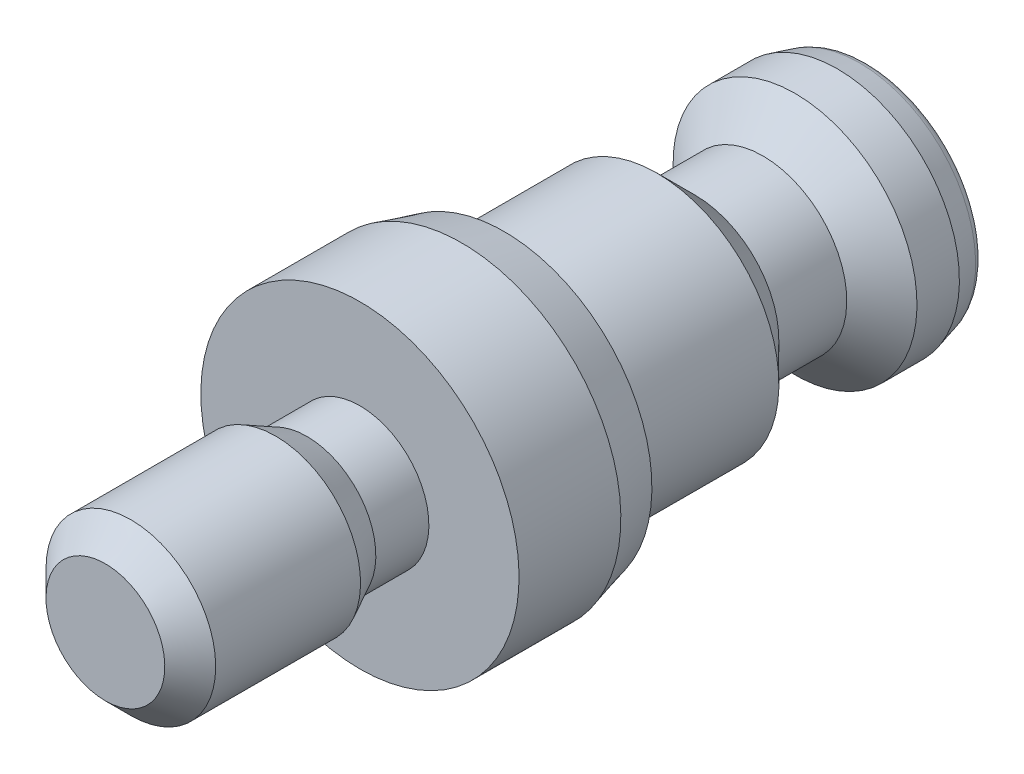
ISO-10303-21;
HEADER;
FILE_DESCRIPTION(('STEP AP214'),'2;1');
FILE_NAME('part.step','',(''),(''),'','','');
FILE_SCHEMA(('AUTOMOTIVE_DESIGN { 1 0 10303 214 1 1 1 1 }'));
ENDSEC;
DATA;
#1=APPLICATION_CONTEXT('core data for automotive mechanical design processes');
#2=APPLICATION_PROTOCOL_DEFINITION('international standard','automotive_design',2000,#1);
#3=PRODUCT_CONTEXT('',#1,'mechanical');
#4=PRODUCT('Part','Part','',(#3));
#5=PRODUCT_RELATED_PRODUCT_CATEGORY('part','',(#4));
#6=PRODUCT_DEFINITION_FORMATION('','',#4);
#7=PRODUCT_DEFINITION_CONTEXT('part definition',#1,'design');
#8=PRODUCT_DEFINITION('design','',#6,#7);
#9=PRODUCT_DEFINITION_SHAPE('','',#8);
#10=(LENGTH_UNIT() NAMED_UNIT(*) SI_UNIT(.MILLI.,.METRE.));
#11=(NAMED_UNIT(*) PLANE_ANGLE_UNIT() SI_UNIT($,.RADIAN.));
#12=(NAMED_UNIT(*) SI_UNIT($,.STERADIAN.) SOLID_ANGLE_UNIT());
#13=UNCERTAINTY_MEASURE_WITH_UNIT(LENGTH_MEASURE(1.E-05),#10,'distance_accuracy_value','');
#14=(GEOMETRIC_REPRESENTATION_CONTEXT(3) GLOBAL_UNCERTAINTY_ASSIGNED_CONTEXT((#13)) GLOBAL_UNIT_ASSIGNED_CONTEXT((#10,
#11,#12)) REPRESENTATION_CONTEXT('',''));
#15=CARTESIAN_POINT('',(0.,0.,0.));
#16=DIRECTION('',(0.,0.,1.));
#17=DIRECTION('',(1.,0.,0.));
#18=AXIS2_PLACEMENT_3D('',#15,#16,#17);
#19=CARTESIAN_POINT('',(0.,-6.,6.));
#20=DIRECTION('',(0.,0.,-1.));
#21=DIRECTION('',(0.,1.,0.));
#22=AXIS2_PLACEMENT_3D('',#19,#20,#21);
#23=CYLINDRICAL_SURFACE('',#22,5.75);
#24=CARTESIAN_POINT('',(0.,-6.,-8.));
#25=DIRECTION('',(0.,0.,-1.));
#26=DIRECTION('',(0.,1.,0.));
#27=AXIS2_PLACEMENT_3D('',#24,#25,#26);
#28=CIRCLE('',#27,5.75);
#29=CARTESIAN_POINT('',(0.,-0.25,-7.99999999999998));
#30=VERTEX_POINT('',#29);
#31=EDGE_CURVE('E138',#30,#30,#28,.T.);
#32=ORIENTED_EDGE('',*,*,#31,.F.);
#33=EDGE_LOOP('',(#32));
#34=FACE_BOUND('',#33,.T.);
#35=CARTESIAN_POINT('',(0.,-6.,-0.8));
#36=DIRECTION('',(0.,0.,1.));
#37=DIRECTION('',(0.,-1.,0.));
#38=AXIS2_PLACEMENT_3D('',#35,#36,#37);
#39=CIRCLE('',#38,5.75);
#40=CARTESIAN_POINT('',(0.,-11.75,-0.80000000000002));
#41=VERTEX_POINT('',#40);
#42=EDGE_CURVE('E123',#41,#41,#39,.T.);
#43=ORIENTED_EDGE('',*,*,#42,.F.);
#44=EDGE_LOOP('',(#43));
#45=FACE_BOUND('',#44,.T.);
#46=ADVANCED_FACE('F15',(#34,#45),#23,.T.);
#47=CARTESIAN_POINT('',(0.,-6.,-9.8));
#48=DIRECTION('',(0.,0.,1.));
#49=DIRECTION('',(0.,-1.,0.));
#50=AXIS2_PLACEMENT_3D('',#47,#48,#49);
#51=CONICAL_SURFACE('',#50,3.95,0.785398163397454);
#52=ORIENTED_EDGE('',*,*,#31,.T.);
#53=EDGE_LOOP('',(#52));
#54=FACE_BOUND('',#53,.T.);
#55=CARTESIAN_POINT('',(0.,-6.,-9.8));
#56=DIRECTION('',(0.,0.,-1.));
#57=DIRECTION('',(0.,1.,0.));
#58=AXIS2_PLACEMENT_3D('',#55,#56,#57);
#59=CIRCLE('',#58,3.95);
#60=CARTESIAN_POINT('',(0.,-2.05,-9.79999999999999));
#61=VERTEX_POINT('',#60);
#62=EDGE_CURVE('E135',#61,#61,#59,.T.);
#63=ORIENTED_EDGE('',*,*,#62,.F.);
#64=EDGE_LOOP('',(#63));
#65=FACE_BOUND('',#64,.T.);
#66=ADVANCED_FACE('F169',(#54,#65),#51,.T.);
#67=CARTESIAN_POINT('',(0.,-6.,6.));
#68=DIRECTION('',(0.,0.,-1.));
#69=DIRECTION('',(0.,1.,0.));
#70=AXIS2_PLACEMENT_3D('',#67,#68,#69);
#71=CYLINDRICAL_SURFACE('',#70,3.95);
#72=ORIENTED_EDGE('',*,*,#62,.T.);
#73=EDGE_LOOP('',(#72));
#74=FACE_BOUND('',#73,.T.);
#75=CARTESIAN_POINT('',(0.,-6.,-13.));
#76=DIRECTION('',(0.,0.,-1.));
#77=DIRECTION('',(0.,1.,0.));
#78=AXIS2_PLACEMENT_3D('',#75,#76,#77);
#79=CIRCLE('',#78,3.95);
#80=CARTESIAN_POINT('',(0.,-2.05,-13.));
#81=VERTEX_POINT('',#80);
#82=EDGE_CURVE('E132',#81,#81,#79,.T.);
#83=ORIENTED_EDGE('',*,*,#82,.F.);
#84=EDGE_LOOP('',(#83));
#85=FACE_BOUND('',#84,.T.);
#86=ADVANCED_FACE('F176',(#74,#85),#71,.T.);
#87=CARTESIAN_POINT('',(0.,-6.,-14.5103793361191));
#88=DIRECTION('',(0.,0.,-1.));
#89=DIRECTION('',(0.,1.,0.));
#90=AXIS2_PLACEMENT_3D('',#87,#88,#89);
#91=CONICAL_SURFACE('',#90,5.75,0.872664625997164);
#92=ORIENTED_EDGE('',*,*,#82,.T.);
#93=EDGE_LOOP('',(#92));
#94=FACE_BOUND('',#93,.T.);
#95=CARTESIAN_POINT('',(0.,-6.,-14.5103793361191));
#96=DIRECTION('',(0.,0.,-1.));
#97=DIRECTION('',(0.,1.,0.));
#98=AXIS2_PLACEMENT_3D('',#95,#96,#97);
#99=CIRCLE('',#98,5.75);
#100=CARTESIAN_POINT('',(0.,-0.25,-14.5103793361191));
#101=VERTEX_POINT('',#100);
#102=EDGE_CURVE('E129',#101,#101,#99,.T.);
#103=ORIENTED_EDGE('',*,*,#102,.F.);
#104=EDGE_LOOP('',(#103));
#105=FACE_BOUND('',#104,.T.);
#106=ADVANCED_FACE('F227',(#94,#105),#91,.T.);
#107=CARTESIAN_POINT('',(0.,-6.,6.));
#108=DIRECTION('',(0.,0.,-1.));
#109=DIRECTION('',(0.,1.,0.));
#110=AXIS2_PLACEMENT_3D('',#107,#108,#109);
#111=CYLINDRICAL_SURFACE('',#110,5.75);
#112=ORIENTED_EDGE('',*,*,#102,.T.);
#113=EDGE_LOOP('',(#112));
#114=FACE_BOUND('',#113,.T.);
#115=CARTESIAN_POINT('',(0.,-6.,-16.5103793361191));
#116=DIRECTION('',(0.,0.,-1.));
#117=DIRECTION('',(0.,1.,0.));
#118=AXIS2_PLACEMENT_3D('',#115,#116,#117);
#119=CIRCLE('',#118,5.75);
#120=CARTESIAN_POINT('',(0.,-0.25,-16.5103793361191));
#121=VERTEX_POINT('',#120);
#122=EDGE_CURVE('E126',#121,#121,#119,.T.);
#123=ORIENTED_EDGE('',*,*,#122,.F.);
#124=EDGE_LOOP('',(#123));
#125=FACE_BOUND('',#124,.T.);
#126=ADVANCED_FACE('F218',(#114,#125),#111,.T.);
#127=CARTESIAN_POINT('',(0.,-6.,-18.));
#128=DIRECTION('',(0.,0.,1.));
#129=DIRECTION('',(0.,-1.,0.));
#130=AXIS2_PLACEMENT_3D('',#127,#128,#129);
#131=CONICAL_SURFACE('',#130,5.3508573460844,0.26179938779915);
#132=CARTESIAN_POINT('',(0.,-6.,-17.5552914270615));
#133=DIRECTION('',(0.,0.,-1.));
#134=DIRECTION('',(0.,1.,0.));
#135=AXIS2_PLACEMENT_3D('',#132,#133,#134);
#136=CIRCLE('',#135,5.47001664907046);
#137=CARTESIAN_POINT('',(0.,-0.52998335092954,-17.5552914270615));
#138=VERTEX_POINT('',#137);
#139=EDGE_CURVE('E150',#138,#138,#136,.F.);
#140=ORIENTED_EDGE('',*,*,#139,.T.);
#141=EDGE_LOOP('',(#140));
#142=FACE_BOUND('',#141,.T.);
#143=ORIENTED_EDGE('',*,*,#122,.T.);
#144=EDGE_LOOP('',(#143));
#145=FACE_BOUND('',#144,.T.);
#146=ADVANCED_FACE('F209',(#142,#145),#131,.T.);
#147=CARTESIAN_POINT('',(5.3508573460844,-6.,-18.));
#148=DIRECTION('',(0.,0.,-1.));
#149=DIRECTION('',(0.,1.,0.));
#150=AXIS2_PLACEMENT_3D('',#147,#148,#149);
#151=PLANE('',#150);
#152=DIRECTION('',(0.5,0.866025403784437,0.));
#153=VECTOR('',#152,1.);
#154=CARTESIAN_POINT('',(-2.30940107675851,-5.99999999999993,-18.));
#155=LINE('',#154,#153);
#156=CARTESIAN_POINT('',(-2.30940107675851,-5.99999999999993,-18.));
#157=VERTEX_POINT('',#156);
#158=CARTESIAN_POINT('',(-1.15470053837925,-3.99999999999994,-18.));
#159=VERTEX_POINT('',#158);
#160=EDGE_CURVE('E55',#157,#159,#155,.T.);
#161=ORIENTED_EDGE('',*,*,#160,.F.);
#162=DIRECTION('',(-0.5,0.866025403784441,0.));
#163=VECTOR('',#162,1.);
#164=CARTESIAN_POINT('',(-1.15470053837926,-8.,-18.));
#165=LINE('',#164,#163);
#166=CARTESIAN_POINT('',(-1.15470053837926,-8.,-18.));
#167=VERTEX_POINT('',#166);
#168=EDGE_CURVE('E98',#167,#157,#165,.T.);
#169=ORIENTED_EDGE('',*,*,#168,.F.);
#170=DIRECTION('',(-1.,0.,0.));
#171=VECTOR('',#170,1.);
#172=CARTESIAN_POINT('',(1.15470053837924,-8.,-18.));
#173=LINE('',#172,#171);
#174=CARTESIAN_POINT('',(1.15470053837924,-8.,-18.));
#175=VERTEX_POINT('',#174);
#176=EDGE_CURVE('E420',#175,#167,#173,.T.);
#177=ORIENTED_EDGE('',*,*,#176,.F.);
#178=DIRECTION('',(-0.5,-0.866025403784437,0.));
#179=VECTOR('',#178,1.);
#180=CARTESIAN_POINT('',(2.3094010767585,-6.,-18.));
#181=LINE('',#180,#179);
#182=CARTESIAN_POINT('',(2.3094010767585,-6.,-18.));
#183=VERTEX_POINT('',#182);
#184=EDGE_CURVE('E423',#183,#175,#181,.T.);
#185=ORIENTED_EDGE('',*,*,#184,.F.);
#186=DIRECTION('',(0.5,-0.86602540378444,0.));
#187=VECTOR('',#186,1.);
#188=CARTESIAN_POINT('',(1.15470053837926,-3.99999999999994,-18.));
#189=LINE('',#188,#187);
#190=CARTESIAN_POINT('',(1.15470053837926,-3.99999999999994,-18.));
#191=VERTEX_POINT('',#190);
#192=EDGE_CURVE('E62',#191,#183,#189,.T.);
#193=ORIENTED_EDGE('',*,*,#192,.F.);
#194=DIRECTION('',(1.,0.,0.));
#195=VECTOR('',#194,1.);
#196=CARTESIAN_POINT('',(-1.15470053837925,-3.99999999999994,-18.));
#197=LINE('',#196,#195);
#198=EDGE_CURVE('E415',#159,#191,#197,.T.);
#199=ORIENTED_EDGE('',*,*,#198,.F.);
#200=EDGE_LOOP('',(#161,#169,#177,#185,#193,#199));
#201=FACE_BOUND('',#200,.T.);
#202=CARTESIAN_POINT('',(0.,-6.,-18.));
#203=DIRECTION('',(0.,0.,-1.));
#204=DIRECTION('',(0.,1.,0.));
#205=AXIS2_PLACEMENT_3D('',#202,#203,#204);
#206=CIRCLE('',#205,4.89046115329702);
#207=CARTESIAN_POINT('',(0.,-1.10953884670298,-18.));
#208=VERTEX_POINT('',#207);
#209=EDGE_CURVE('E147',#208,#208,#206,.T.);
#210=ORIENTED_EDGE('',*,*,#209,.T.);
#211=EDGE_LOOP('',(#210));
#212=FACE_BOUND('',#211,.T.);
#213=ADVANCED_FACE('F206',(#201,#212),#151,.T.);
#214=CARTESIAN_POINT('',(5.75,-6.,-0.8));
#215=DIRECTION('',(0.,0.,1.));
#216=DIRECTION('',(0.,-1.,0.));
#217=AXIS2_PLACEMENT_3D('',#214,#215,#216);
#218=PLANE('',#217);
#219=CARTESIAN_POINT('',(0.,-6.,-0.8));
#220=DIRECTION('',(0.,0.,1.));
#221=DIRECTION('',(0.,-1.,0.));
#222=AXIS2_PLACEMENT_3D('',#219,#220,#221);
#223=CIRCLE('',#222,6.96410161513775);
#224=CARTESIAN_POINT('',(0.,-12.9641016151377,-0.800000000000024));
#225=VERTEX_POINT('',#224);
#226=EDGE_CURVE('E9',#225,#225,#223,.F.);
#227=ORIENTED_EDGE('',*,*,#226,.T.);
#228=EDGE_LOOP('',(#227));
#229=FACE_BOUND('',#228,.T.);
#230=ORIENTED_EDGE('',*,*,#42,.T.);
#231=EDGE_LOOP('',(#230));
#232=FACE_BOUND('',#231,.T.);
#233=ADVANCED_FACE('F208',(#229,#232),#218,.F.);
#234=CARTESIAN_POINT('',(0.,-6.,6.));
#235=DIRECTION('',(0.,0.,1.));
#236=DIRECTION('',(0.,-1.,0.));
#237=AXIS2_PLACEMENT_3D('',#234,#235,#236);
#238=CYLINDRICAL_SURFACE('',#237,7.5);
#239=CARTESIAN_POINT('',(0.,-6.,1.2));
#240=DIRECTION('',(0.,0.,1.));
#241=DIRECTION('',(0.,-1.,0.));
#242=AXIS2_PLACEMENT_3D('',#239,#240,#241);
#243=CIRCLE('',#242,7.5);
#244=CARTESIAN_POINT('',(0.,-13.5,1.19999999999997));
#245=VERTEX_POINT('',#244);
#246=EDGE_CURVE('E24',#245,#245,#243,.T.);
#247=ORIENTED_EDGE('',*,*,#246,.T.);
#248=EDGE_LOOP('',(#247));
#249=FACE_BOUND('',#248,.T.);
#250=CARTESIAN_POINT('',(0.,-6.,6.));
#251=DIRECTION('',(0.,0.,1.));
#252=DIRECTION('',(0.,-1.,0.));
#253=AXIS2_PLACEMENT_3D('',#250,#251,#252);
#254=CIRCLE('',#253,7.5);
#255=CARTESIAN_POINT('',(0.,-13.5,5.99999999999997));
#256=VERTEX_POINT('',#255);
#257=EDGE_CURVE('E120',#256,#256,#254,.T.);
#258=ORIENTED_EDGE('',*,*,#257,.F.);
#259=EDGE_LOOP('',(#258));
#260=FACE_BOUND('',#259,.T.);
#261=ADVANCED_FACE('F155',(#249,#260),#238,.T.);
#262=CARTESIAN_POINT('',(0.,-6.,6.));
#263=DIRECTION('',(0.,0.,1.));
#264=DIRECTION('',(0.,-1.,0.));
#265=AXIS2_PLACEMENT_3D('',#262,#263,#264);
#266=PLANE('',#265);
#267=ORIENTED_EDGE('',*,*,#257,.T.);
#268=EDGE_LOOP('',(#267));
#269=FACE_BOUND('',#268,.T.);
#270=CARTESIAN_POINT('',(0.,-6.,6.));
#271=DIRECTION('',(0.,0.,-1.));
#272=DIRECTION('',(0.,1.,0.));
#273=AXIS2_PLACEMENT_3D('',#270,#271,#272);
#274=CIRCLE('',#273,3.25);
#275=CARTESIAN_POINT('',(0.,-2.75,6.00000000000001));
#276=VERTEX_POINT('',#275);
#277=EDGE_CURVE('E111',#276,#276,#274,.T.);
#278=ORIENTED_EDGE('',*,*,#277,.T.);
#279=EDGE_LOOP('',(#278));
#280=FACE_BOUND('',#279,.T.);
#281=ADVANCED_FACE('F183',(#269,#280),#266,.T.);
#282=CARTESIAN_POINT('',(0.,-6.,9.97195787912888));
#283=DIRECTION('',(0.,0.,1.));
#284=DIRECTION('',(0.,-1.,0.));
#285=AXIS2_PLACEMENT_3D('',#282,#283,#284);
#286=CONICAL_SURFACE('',#285,4.,0.471238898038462);
#287=CARTESIAN_POINT('',(0.,-6.,8.5));
#288=DIRECTION('',(0.,0.,-1.));
#289=DIRECTION('',(0.,1.,0.));
#290=AXIS2_PLACEMENT_3D('',#287,#288,#289);
#291=CIRCLE('',#290,3.25);
#292=CARTESIAN_POINT('',(0.,-2.75,8.50000000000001));
#293=VERTEX_POINT('',#292);
#294=EDGE_CURVE('E114',#293,#293,#291,.T.);
#295=ORIENTED_EDGE('',*,*,#294,.F.);
#296=EDGE_LOOP('',(#295));
#297=FACE_BOUND('',#296,.T.);
#298=CARTESIAN_POINT('',(0.,-6.,9.97195787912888));
#299=DIRECTION('',(0.,0.,-1.));
#300=DIRECTION('',(0.,1.,0.));
#301=AXIS2_PLACEMENT_3D('',#298,#299,#300);
#302=CIRCLE('',#301,4.);
#303=CARTESIAN_POINT('',(0.,-2.,9.97195787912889));
#304=VERTEX_POINT('',#303);
#305=EDGE_CURVE('E117',#304,#304,#302,.T.);
#306=ORIENTED_EDGE('',*,*,#305,.T.);
#307=EDGE_LOOP('',(#306));
#308=FACE_BOUND('',#307,.T.);
#309=ADVANCED_FACE('F186',(#297,#308),#286,.T.);
#310=CARTESIAN_POINT('',(0.,-6.,6.));
#311=DIRECTION('',(0.,0.,-1.));
#312=DIRECTION('',(0.,1.,0.));
#313=AXIS2_PLACEMENT_3D('',#310,#311,#312);
#314=CYLINDRICAL_SURFACE('',#313,3.25);
#315=ORIENTED_EDGE('',*,*,#277,.F.);
#316=EDGE_LOOP('',(#315));
#317=FACE_BOUND('',#316,.T.);
#318=ORIENTED_EDGE('',*,*,#294,.T.);
#319=EDGE_LOOP('',(#318));
#320=FACE_BOUND('',#319,.T.);
#321=ADVANCED_FACE('F375',(#317,#320),#314,.T.);
#322=CARTESIAN_POINT('',(0.,-6.,18.));
#323=DIRECTION('',(0.,0.,1.));
#324=DIRECTION('',(0.,-1.,0.));
#325=AXIS2_PLACEMENT_3D('',#322,#323,#324);
#326=PLANE('',#325);
#327=CARTESIAN_POINT('',(0.,-6.,18.));
#328=DIRECTION('',(0.,0.,1.));
#329=DIRECTION('',(0.,-1.,0.));
#330=AXIS2_PLACEMENT_3D('',#327,#328,#329);
#331=CIRCLE('',#330,2.8);
#332=CARTESIAN_POINT('',(0.,-8.8,18.));
#333=VERTEX_POINT('',#332);
#334=EDGE_CURVE('E144',#333,#333,#331,.T.);
#335=ORIENTED_EDGE('',*,*,#334,.T.);
#336=EDGE_LOOP('',(#335));
#337=FACE_BOUND('',#336,.T.);
#338=ADVANCED_FACE('F222',(#337),#326,.T.);
#339=CARTESIAN_POINT('',(0.,-6.,6.));
#340=DIRECTION('',(0.,0.,-1.));
#341=DIRECTION('',(0.,1.,0.));
#342=AXIS2_PLACEMENT_3D('',#339,#340,#341);
#343=CYLINDRICAL_SURFACE('',#342,4.);
#344=CARTESIAN_POINT('',(0.,-6.,16.8));
#345=DIRECTION('',(0.,0.,1.));
#346=DIRECTION('',(0.,-1.,0.));
#347=AXIS2_PLACEMENT_3D('',#344,#345,#346);
#348=CIRCLE('',#347,4.);
#349=CARTESIAN_POINT('',(0.,-10.,16.8));
#350=VERTEX_POINT('',#349);
#351=EDGE_CURVE('E141',#350,#350,#348,.F.);
#352=ORIENTED_EDGE('',*,*,#351,.T.);
#353=EDGE_LOOP('',(#352));
#354=FACE_BOUND('',#353,.T.);
#355=ORIENTED_EDGE('',*,*,#305,.F.);
#356=EDGE_LOOP('',(#355));
#357=FACE_BOUND('',#356,.T.);
#358=ADVANCED_FACE('F191',(#354,#357),#343,.T.);
#359=CARTESIAN_POINT('',(0.,-6.,16.8));
#360=DIRECTION('',(0.,0.,-1.));
#361=DIRECTION('',(0.,1.,0.));
#362=AXIS2_PLACEMENT_3D('',#359,#360,#361);
#363=CONICAL_SURFACE('',#362,4.,0.785398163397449);
#364=ORIENTED_EDGE('',*,*,#334,.F.);
#365=EDGE_LOOP('',(#364));
#366=FACE_BOUND('',#365,.T.);
#367=ORIENTED_EDGE('',*,*,#351,.F.);
#368=EDGE_LOOP('',(#367));
#369=FACE_BOUND('',#368,.T.);
#370=ADVANCED_FACE('F188',(#366,#369),#363,.T.);
#371=CARTESIAN_POINT('',(0.,-6.,-17.4));
#372=DIRECTION('',(0.,0.,-1.));
#373=DIRECTION('',(0.,1.,0.));
#374=AXIS2_PLACEMENT_3D('',#371,#372,#373);
#375=TOROIDAL_SURFACE('',#374,4.89046115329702,0.6);
#376=ORIENTED_EDGE('',*,*,#139,.F.);
#377=EDGE_LOOP('',(#376));
#378=FACE_BOUND('',#377,.T.);
#379=ORIENTED_EDGE('',*,*,#209,.F.);
#380=EDGE_LOOP('',(#379));
#381=FACE_BOUND('',#380,.T.);
#382=ADVANCED_FACE('F190',(#378,#381),#375,.T.);
#383=CARTESIAN_POINT('',(1.15470053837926,-3.99999999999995,-15.));
#384=DIRECTION('',(0.86602540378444,0.5,0.));
#385=DIRECTION('',(-0.5,0.86602540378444,0.));
#386=AXIS2_PLACEMENT_3D('',#383,#384,#385);
#387=PLANE('',#386);
#388=ORIENTED_EDGE('',*,*,#192,.T.);
#389=DIRECTION('',(0.,0.,-1.));
#390=VECTOR('',#389,1.);
#391=CARTESIAN_POINT('',(2.3094010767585,-6.,-15.));
#392=LINE('',#391,#390);
#393=CARTESIAN_POINT('',(2.3094010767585,-6.,-15.));
#394=VERTEX_POINT('',#393);
#395=EDGE_CURVE('E109',#394,#183,#392,.T.);
#396=ORIENTED_EDGE('',*,*,#395,.F.);
#397=DIRECTION('',(0.5,-0.86602540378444,0.));
#398=VECTOR('',#397,1.);
#399=CARTESIAN_POINT('',(1.15470053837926,-3.99999999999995,-15.));
#400=LINE('',#399,#398);
#401=CARTESIAN_POINT('',(1.15470053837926,-3.99999999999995,-15.));
#402=VERTEX_POINT('',#401);
#403=EDGE_CURVE('E32',#402,#394,#400,.T.);
#404=ORIENTED_EDGE('',*,*,#403,.F.);
#405=DIRECTION('',(0.,0.,-1.));
#406=VECTOR('',#405,1.);
#407=CARTESIAN_POINT('',(1.15470053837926,-3.99999999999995,-15.));
#408=LINE('',#407,#406);
#409=EDGE_CURVE('E101',#402,#191,#408,.T.);
#410=ORIENTED_EDGE('',*,*,#409,.T.);
#411=EDGE_LOOP('',(#388,#396,#404,#410));
#412=FACE_BOUND('',#411,.T.);
#413=ADVANCED_FACE('F194',(#412),#387,.F.);
#414=CARTESIAN_POINT('',(-1.15470053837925,-3.99999999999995,-15.));
#415=DIRECTION('',(0.,1.,0.));
#416=DIRECTION('',(-1.,0.,0.));
#417=AXIS2_PLACEMENT_3D('',#414,#415,#416);
#418=PLANE('',#417);
#419=ORIENTED_EDGE('',*,*,#198,.T.);
#420=ORIENTED_EDGE('',*,*,#409,.F.);
#421=DIRECTION('',(1.,0.,0.));
#422=VECTOR('',#421,1.);
#423=CARTESIAN_POINT('',(-1.15470053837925,-3.99999999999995,-15.));
#424=LINE('',#423,#422);
#425=CARTESIAN_POINT('',(-1.15470053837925,-3.99999999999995,-15.));
#426=VERTEX_POINT('',#425);
#427=EDGE_CURVE('E86',#426,#402,#424,.T.);
#428=ORIENTED_EDGE('',*,*,#427,.F.);
#429=DIRECTION('',(0.,0.,-1.));
#430=VECTOR('',#429,1.);
#431=CARTESIAN_POINT('',(-1.15470053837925,-3.99999999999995,-15.));
#432=LINE('',#431,#430);
#433=EDGE_CURVE('E84',#426,#159,#432,.T.);
#434=ORIENTED_EDGE('',*,*,#433,.T.);
#435=EDGE_LOOP('',(#419,#420,#428,#434));
#436=FACE_BOUND('',#435,.T.);
#437=ADVANCED_FACE('F200',(#436),#418,.F.);
#438=CARTESIAN_POINT('',(-2.30940107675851,-6.,-15.));
#439=DIRECTION('',(-0.866025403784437,0.5,0.));
#440=DIRECTION('',(-0.5,-0.866025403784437,0.));
#441=AXIS2_PLACEMENT_3D('',#438,#439,#440);
#442=PLANE('',#441);
#443=ORIENTED_EDGE('',*,*,#160,.T.);
#444=ORIENTED_EDGE('',*,*,#433,.F.);
#445=DIRECTION('',(0.5,0.866025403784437,0.));
#446=VECTOR('',#445,1.);
#447=CARTESIAN_POINT('',(-2.30940107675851,-6.,-15.));
#448=LINE('',#447,#446);
#449=CARTESIAN_POINT('',(-2.30940107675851,-6.,-15.));
#450=VERTEX_POINT('',#449);
#451=EDGE_CURVE('E79',#450,#426,#448,.T.);
#452=ORIENTED_EDGE('',*,*,#451,.F.);
#453=DIRECTION('',(0.,0.,-1.));
#454=VECTOR('',#453,1.);
#455=CARTESIAN_POINT('',(-2.30940107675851,-6.,-15.));
#456=LINE('',#455,#454);
#457=EDGE_CURVE('E83',#450,#157,#456,.T.);
#458=ORIENTED_EDGE('',*,*,#457,.T.);
#459=EDGE_LOOP('',(#443,#444,#452,#458));
#460=FACE_BOUND('',#459,.T.);
#461=ADVANCED_FACE('F81',(#460),#442,.F.);
#462=CARTESIAN_POINT('',(-1.15470053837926,-8.,-15.));
#463=DIRECTION('',(-0.86602540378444,-0.5,0.));
#464=DIRECTION('',(0.5,-0.866025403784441,0.));
#465=AXIS2_PLACEMENT_3D('',#462,#463,#464);
#466=PLANE('',#465);
#467=ORIENTED_EDGE('',*,*,#168,.T.);
#468=ORIENTED_EDGE('',*,*,#457,.F.);
#469=DIRECTION('',(-0.5,0.866025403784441,0.));
#470=VECTOR('',#469,1.);
#471=CARTESIAN_POINT('',(-1.15470053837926,-8.,-15.));
#472=LINE('',#471,#470);
#473=CARTESIAN_POINT('',(-1.15470053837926,-8.,-15.));
#474=VERTEX_POINT('',#473);
#475=EDGE_CURVE('E87',#474,#450,#472,.T.);
#476=ORIENTED_EDGE('',*,*,#475,.F.);
#477=DIRECTION('',(0.,0.,-1.));
#478=VECTOR('',#477,1.);
#479=CARTESIAN_POINT('',(-1.15470053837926,-8.,-15.));
#480=LINE('',#479,#478);
#481=EDGE_CURVE('E99',#474,#167,#480,.T.);
#482=ORIENTED_EDGE('',*,*,#481,.T.);
#483=EDGE_LOOP('',(#467,#468,#476,#482));
#484=FACE_BOUND('',#483,.T.);
#485=ADVANCED_FACE('F97',(#484),#466,.F.);
#486=CARTESIAN_POINT('',(1.15470053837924,-8.,-15.));
#487=DIRECTION('',(0.,-1.,0.));
#488=DIRECTION('',(1.,0.,0.));
#489=AXIS2_PLACEMENT_3D('',#486,#487,#488);
#490=PLANE('',#489);
#491=ORIENTED_EDGE('',*,*,#176,.T.);
#492=ORIENTED_EDGE('',*,*,#481,.F.);
#493=DIRECTION('',(-1.,0.,0.));
#494=VECTOR('',#493,1.);
#495=CARTESIAN_POINT('',(1.15470053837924,-8.,-15.));
#496=LINE('',#495,#494);
#497=CARTESIAN_POINT('',(1.15470053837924,-8.,-15.));
#498=VERTEX_POINT('',#497);
#499=EDGE_CURVE('E91',#498,#474,#496,.T.);
#500=ORIENTED_EDGE('',*,*,#499,.F.);
#501=DIRECTION('',(0.,0.,-1.));
#502=VECTOR('',#501,1.);
#503=CARTESIAN_POINT('',(1.15470053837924,-8.,-15.));
#504=LINE('',#503,#502);
#505=EDGE_CURVE('E103',#498,#175,#504,.T.);
#506=ORIENTED_EDGE('',*,*,#505,.T.);
#507=EDGE_LOOP('',(#491,#492,#500,#506));
#508=FACE_BOUND('',#507,.T.);
#509=ADVANCED_FACE('F333',(#508),#490,.F.);
#510=CARTESIAN_POINT('',(2.3094010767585,-6.,-15.));
#511=DIRECTION('',(0.866025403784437,-0.5,0.));
#512=DIRECTION('',(0.5,0.866025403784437,0.));
#513=AXIS2_PLACEMENT_3D('',#510,#511,#512);
#514=PLANE('',#513);
#515=ORIENTED_EDGE('',*,*,#184,.T.);
#516=ORIENTED_EDGE('',*,*,#505,.F.);
#517=DIRECTION('',(-0.5,-0.866025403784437,0.));
#518=VECTOR('',#517,1.);
#519=CARTESIAN_POINT('',(2.3094010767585,-6.,-15.));
#520=LINE('',#519,#518);
#521=EDGE_CURVE('E71',#394,#498,#520,.T.);
#522=ORIENTED_EDGE('',*,*,#521,.F.);
#523=ORIENTED_EDGE('',*,*,#395,.T.);
#524=EDGE_LOOP('',(#515,#516,#522,#523));
#525=FACE_BOUND('',#524,.T.);
#526=ADVANCED_FACE('F165',(#525),#514,.F.);
#527=CARTESIAN_POINT('',(0.,-6.,-15.));
#528=DIRECTION('',(0.,0.,-1.));
#529=DIRECTION('',(0.,1.,0.));
#530=AXIS2_PLACEMENT_3D('',#527,#528,#529);
#531=PLANE('',#530);
#532=ORIENTED_EDGE('',*,*,#451,.T.);
#533=ORIENTED_EDGE('',*,*,#427,.T.);
#534=ORIENTED_EDGE('',*,*,#403,.T.);
#535=ORIENTED_EDGE('',*,*,#521,.T.);
#536=ORIENTED_EDGE('',*,*,#499,.T.);
#537=ORIENTED_EDGE('',*,*,#475,.T.);
#538=EDGE_LOOP('',(#532,#533,#534,#535,#536,#537));
#539=FACE_BOUND('',#538,.T.);
#540=ADVANCED_FACE('F90',(#539),#531,.T.);
#541=CARTESIAN_POINT('',(0.,-6.,1.2));
#542=DIRECTION('',(0.,0.,1.));
#543=DIRECTION('',(0.,-1.,0.));
#544=AXIS2_PLACEMENT_3D('',#541,#542,#543);
#545=CONICAL_SURFACE('',#544,7.5,0.261799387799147);
#546=ORIENTED_EDGE('',*,*,#226,.F.);
#547=EDGE_LOOP('',(#546));
#548=FACE_BOUND('',#547,.T.);
#549=ORIENTED_EDGE('',*,*,#246,.F.);
#550=EDGE_LOOP('',(#549));
#551=FACE_BOUND('',#550,.T.);
#552=ADVANCED_FACE('F17',(#548,#551),#545,.T.);
#553=CLOSED_SHELL('',(#46,#66,#86,#106,#126,#146,#213,#233,#261,#281,#309,#321,#338,#358,#370,
#382,#413,#437,#461,#485,#509,#526,#540,#552));
#554=MANIFOLD_SOLID_BREP('B1',#553);
#555=ADVANCED_BREP_SHAPE_REPRESENTATION('',(#18,#554),#14);
#556=SHAPE_DEFINITION_REPRESENTATION(#9,#555);
ENDSEC;
END-ISO-10303-21;
